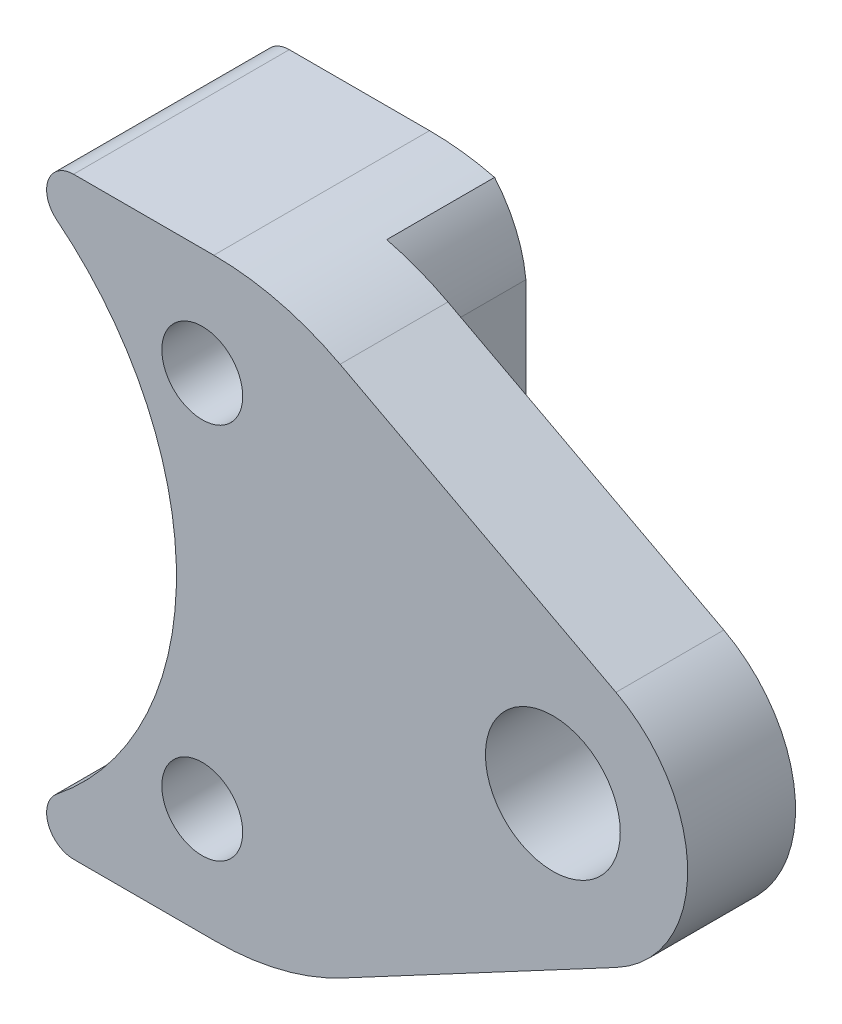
from build123d import *

# Parameters (mm, degrees)
ESQUISSE1_R             = 1.5
ESQUISSE1_R_2           = 2.5
EXTRUSION1_DEPTH        = 8
CONG_1_R                = 10
ENL_V_START             = -4
ENL_V_MAT_EXTRU_1_DEPTH = 4


with BuildPart() as part:
    # Esquisse1 → Extrusion1 (new body)
    with BuildSketch(Plane.XY):
        with BuildLine():
            Line((20, -11), (12.227935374, -11))
            ThreePointArc((12.227935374, -11), (11.28408436, -10.330371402), (11.604292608, -9.218290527))
            ThreePointArc((11.604292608, -9.218290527), (16.042476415, 0), (11.604292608, 9.218290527))
            ThreePointArc((11.604292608, 9.218290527), (11.28408436, 10.330371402), (12.227935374, 11))
            Line((12.227935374, 11), (19.913276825, 11))
            Line((19.913276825, 11), (32.34013407, 4.418571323))
            ThreePointArc((32.34013407, 4.418571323), (34.999994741, 0.007251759), (32.352941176, -4.411764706))
            Line((32.352941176, -4.411764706), (20, -11))
        make_face()
        with Locations((17, 7)):
            Circle(ESQUISSE1_R, mode=Mode.SUBTRACT)
        with Locations(Location((17, -7, 0), (0, 0, 180))):
            Circle(ESQUISSE1_R, mode=Mode.SUBTRACT)
        with Locations((30, 0)):
            Circle(ESQUISSE1_R_2, mode=Mode.SUBTRACT)
    extrude(amount=EXTRUSION1_DEPTH)

    # Cong_1
    cong_1_edges = [part.edges().sort_by_distance(p)[0] for p in [
        (19.913276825, 11, 4),
        (20, -11, 4),
    ]]
    fillet(cong_1_edges, radius=CONG_1_R)

    # Esquisse2 → Enl_v. mat.-Extru.1 (cut)
    with BuildSketch(Plane(origin=(0, 0, 0), x_dir=(-1, 0, 0), z_dir=(0, 0, -1)).offset(ENL_V_START)):
        with BuildLine():
            Line((-32.34013407, 4.418571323), (-22.108949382, 9.837142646))
            ThreePointArc((-22.108949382, 9.837142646), (-21.000906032, 10.340193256), (-19.839964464, 10.704932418))
            ThreePointArc((-19.839964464, 10.704932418), (-20.626650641, 9.441097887), (-21, 8))
            Line((-21, 8), (-21, -8))
            ThreePointArc((-21, -8), (-20.505188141, -9.635488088), (-19.291478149, -10.838221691))
            ThreePointArc((-19.291478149, -10.838221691), (-20.788057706, -10.443975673), (-22.205882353, -9.823529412))
            Line((-22.205882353, -9.823529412), (-32.352941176, -4.411764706))
            ThreePointArc((-32.352941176, -4.411764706), (-34.999994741, 0.007251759), (-32.34013407, 4.418571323))
        make_face()
    extrude(amount=ENL_V_MAT_EXTRU_1_DEPTH, mode=Mode.SUBTRACT)


solid = part.part
